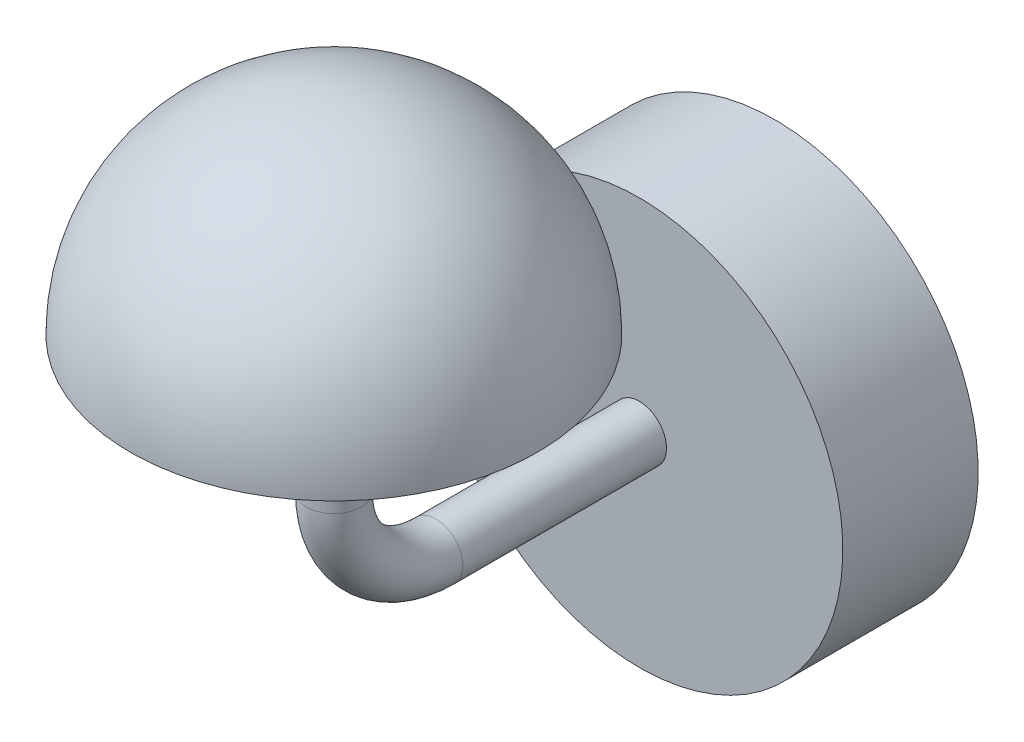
ISO-10303-21;
HEADER;
FILE_DESCRIPTION(('STEP AP214'),'2;1');
FILE_NAME('part.step','',(''),(''),'','','');
FILE_SCHEMA(('AUTOMOTIVE_DESIGN { 1 0 10303 214 1 1 1 1 }'));
ENDSEC;
DATA;
#1=APPLICATION_CONTEXT('core data for automotive mechanical design processes');
#2=APPLICATION_PROTOCOL_DEFINITION('international standard','automotive_design',2000,#1);
#3=PRODUCT_CONTEXT('',#1,'mechanical');
#4=PRODUCT('Part','Part','',(#3));
#5=PRODUCT_RELATED_PRODUCT_CATEGORY('part','',(#4));
#6=PRODUCT_DEFINITION_FORMATION('','',#4);
#7=PRODUCT_DEFINITION_CONTEXT('part definition',#1,'design');
#8=PRODUCT_DEFINITION('design','',#6,#7);
#9=PRODUCT_DEFINITION_SHAPE('','',#8);
#10=(LENGTH_UNIT() NAMED_UNIT(*) SI_UNIT(.MILLI.,.METRE.));
#11=(NAMED_UNIT(*) PLANE_ANGLE_UNIT() SI_UNIT($,.RADIAN.));
#12=(NAMED_UNIT(*) SI_UNIT($,.STERADIAN.) SOLID_ANGLE_UNIT());
#13=UNCERTAINTY_MEASURE_WITH_UNIT(LENGTH_MEASURE(1.E-05),#10,'distance_accuracy_value','');
#14=(GEOMETRIC_REPRESENTATION_CONTEXT(3) GLOBAL_UNCERTAINTY_ASSIGNED_CONTEXT((#13)) GLOBAL_UNIT_ASSIGNED_CONTEXT((#10,
#11,#12)) REPRESENTATION_CONTEXT('',''));
#15=CARTESIAN_POINT('',(0.,0.,0.));
#16=DIRECTION('',(0.,0.,1.));
#17=DIRECTION('',(1.,0.,0.));
#18=AXIS2_PLACEMENT_3D('',#15,#16,#17);
#19=CARTESIAN_POINT('',(11.3333843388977,-28.8148544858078,230.500000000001));
#20=DIRECTION('',(-1.,0.,0.));
#21=DIRECTION('',(0.,0.,-1.));
#22=AXIS2_PLACEMENT_3D('',#19,#20,#21);
#23=TOROIDAL_SURFACE('',#22,29.9999999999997,8.);
#24=CARTESIAN_POINT('',(11.3333843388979,-58.8148544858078,230.500000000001));
#25=DIRECTION('',(0.,0.,-1.));
#26=DIRECTION('',(-1.,0.,0.));
#27=AXIS2_PLACEMENT_3D('',#24,#25,#26);
#28=CIRCLE('',#27,8.);
#29=CARTESIAN_POINT('',(11.333384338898,-66.8148544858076,230.500000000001));
#30=VERTEX_POINT('',#29);
#31=EDGE_CURVE('P0_E61',#30,#30,#28,.T.);
#32=CARTESIAN_POINT('',(11.3333843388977,-28.8148544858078,260.500000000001));
#33=DIRECTION('',(0.,-1.,0.));
#34=DIRECTION('',(1.,0.,0.));
#35=AXIS2_PLACEMENT_3D('',#32,#33,#34);
#36=CIRCLE('',#35,8.);
#37=CARTESIAN_POINT('',(11.3333843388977,-28.8148544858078,268.5));
#38=VERTEX_POINT('',#37);
#39=EDGE_CURVE('P0_E11',#38,#38,#36,.F.);
#40=CARTESIAN_POINT('',(11.3333843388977,-28.8148544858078,230.500000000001));
#41=DIRECTION('',(-1.,0.,0.));
#42=DIRECTION('',(0.,0.,-1.));
#43=AXIS2_PLACEMENT_3D('',#40,#41,#42);
#44=CIRCLE('',#43,37.9999999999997);
#45=EDGE_CURVE('',#30,#38,#44,.T.);
#46=ORIENTED_EDGE('',*,*,#31,.F.);
#47=ORIENTED_EDGE('',*,*,#39,.F.);
#48=ORIENTED_EDGE('',*,*,#45,.T.);
#49=ORIENTED_EDGE('',*,*,#45,.F.);
#50=EDGE_LOOP('',(#46,#48,#47,#49));
#51=FACE_BOUND('',#50,.T.);
#52=ADVANCED_FACE('P0_F48',(#51),#23,.T.);
#53=CARTESIAN_POINT('',(11.3333843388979,-58.8148544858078,170.500000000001));
#54=DIRECTION('',(0.,0.,1.));
#55=DIRECTION('',(1.,0.,0.));
#56=AXIS2_PLACEMENT_3D('',#53,#54,#55);
#57=CYLINDRICAL_SURFACE('',#56,8.);
#58=CARTESIAN_POINT('',(11.3333843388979,-58.8148544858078,170.500000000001));
#59=DIRECTION('',(0.,0.,-1.));
#60=DIRECTION('',(-1.,0.,0.));
#61=AXIS2_PLACEMENT_3D('',#58,#59,#60);
#62=CIRCLE('',#61,8.);
#63=CARTESIAN_POINT('',(3.33338433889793,-58.8148544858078,170.500000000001));
#64=VERTEX_POINT('',#63);
#65=EDGE_CURVE('P0_E55',#64,#64,#62,.T.);
#66=ORIENTED_EDGE('',*,*,#65,.F.);
#67=EDGE_LOOP('',(#66));
#68=FACE_BOUND('',#67,.T.);
#69=ORIENTED_EDGE('',*,*,#31,.T.);
#70=EDGE_LOOP('',(#69));
#71=FACE_BOUND('',#70,.T.);
#72=ADVANCED_FACE('P0_F96',(#68,#71),#57,.T.);
#73=CARTESIAN_POINT('',(11.3333843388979,-58.8148544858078,130.622000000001));
#74=DIRECTION('',(0.,0.,1.));
#75=DIRECTION('',(1.,0.,0.));
#76=AXIS2_PLACEMENT_3D('',#73,#74,#75);
#77=CYLINDRICAL_SURFACE('',#76,59.944);
#78=CARTESIAN_POINT('',(11.3333843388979,-58.8148544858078,130.622000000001));
#79=DIRECTION('',(0.,0.,1.));
#80=DIRECTION('',(-1.,0.,0.));
#81=AXIS2_PLACEMENT_3D('',#78,#79,#80);
#82=CIRCLE('',#81,59.944);
#83=CARTESIAN_POINT('',(-48.6106156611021,-58.8148544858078,130.622000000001));
#84=VERTEX_POINT('',#83);
#85=EDGE_CURVE('P0_E67',#84,#84,#82,.T.);
#86=ORIENTED_EDGE('',*,*,#85,.T.);
#87=EDGE_LOOP('',(#86));
#88=FACE_BOUND('',#87,.T.);
#89=CARTESIAN_POINT('',(11.3333843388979,-58.8148544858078,170.500000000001));
#90=DIRECTION('',(0.,0.,1.));
#91=DIRECTION('',(-1.,0.,0.));
#92=AXIS2_PLACEMENT_3D('',#89,#90,#91);
#93=CIRCLE('',#92,59.944);
#94=CARTESIAN_POINT('',(-48.6106156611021,-58.8148544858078,170.500000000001));
#95=VERTEX_POINT('',#94);
#96=EDGE_CURVE('P0_E69',#95,#95,#93,.T.);
#97=ORIENTED_EDGE('',*,*,#96,.F.);
#98=EDGE_LOOP('',(#97));
#99=FACE_BOUND('',#98,.T.);
#100=ADVANCED_FACE('P0_F102',(#88,#99),#77,.T.);
#101=CARTESIAN_POINT('',(11.3333843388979,-58.8148544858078,130.622000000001));
#102=DIRECTION('',(0.,0.,-1.));
#103=DIRECTION('',(-1.,0.,0.));
#104=AXIS2_PLACEMENT_3D('',#101,#102,#103);
#105=PLANE('',#104);
#106=ORIENTED_EDGE('',*,*,#85,.F.);
#107=EDGE_LOOP('',(#106));
#108=FACE_BOUND('',#107,.T.);
#109=ADVANCED_FACE('P0_F92',(#108),#105,.T.);
#110=CARTESIAN_POINT('',(11.3333843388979,-58.8148544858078,170.500000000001));
#111=DIRECTION('',(0.,0.,-1.));
#112=DIRECTION('',(-1.,0.,0.));
#113=AXIS2_PLACEMENT_3D('',#110,#111,#112);
#114=PLANE('',#113);
#115=ORIENTED_EDGE('',*,*,#65,.T.);
#116=EDGE_LOOP('',(#115));
#117=FACE_BOUND('',#116,.T.);
#118=ORIENTED_EDGE('',*,*,#96,.T.);
#119=EDGE_LOOP('',(#118));
#120=FACE_BOUND('',#119,.T.);
#121=ADVANCED_FACE('P0_F85',(#117,#120),#114,.F.);
#122=CARTESIAN_POINT('',(11.3333843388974,11.1851455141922,260.500000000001));
#123=DIRECTION('',(0.,-1.,0.));
#124=DIRECTION('',(1.,0.,0.));
#125=AXIS2_PLACEMENT_3D('',#122,#123,#124);
#126=CYLINDRICAL_SURFACE('',#125,8.);
#127=CARTESIAN_POINT('',(11.3333843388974,11.1851455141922,260.500000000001));
#128=DIRECTION('',(0.,1.,0.));
#129=DIRECTION('',(-1.,0.,0.));
#130=AXIS2_PLACEMENT_3D('',#127,#128,#129);
#131=CIRCLE('',#130,8.);
#132=CARTESIAN_POINT('',(3.33338433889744,11.1851455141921,260.500000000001));
#133=VERTEX_POINT('',#132);
#134=EDGE_CURVE('P0_E73',#133,#133,#131,.T.);
#135=ORIENTED_EDGE('',*,*,#134,.F.);
#136=EDGE_LOOP('',(#135));
#137=FACE_BOUND('',#136,.T.);
#138=ORIENTED_EDGE('',*,*,#39,.T.);
#139=EDGE_LOOP('',(#138));
#140=FACE_BOUND('',#139,.T.);
#141=ADVANCED_FACE('P0_F83',(#137,#140),#126,.T.);
#142=CARTESIAN_POINT('',(11.3333843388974,11.1851455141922,260.500000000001));
#143=DIRECTION('',(0.,1.,0.));
#144=DIRECTION('',(-1.,0.,0.));
#145=AXIS2_PLACEMENT_3D('',#142,#143,#144);
#146=PLANE('',#145);
#147=ORIENTED_EDGE('',*,*,#134,.T.);
#148=EDGE_LOOP('',(#147));
#149=FACE_BOUND('',#148,.T.);
#150=ADVANCED_FACE('P0_F81',(#149),#146,.T.);
#151=CLOSED_SHELL('',(#52,#72,#100,#109,#121,#141,#150));
#152=MANIFOLD_SOLID_BREP('P0_B2',#151);
#153=CARTESIAN_POINT('',(11.3333843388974,11.1851455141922,260.500000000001));
#154=DIRECTION('',(0.,1.,0.));
#155=DIRECTION('',(-0.617305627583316,0.,0.786723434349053));
#156=AXIS2_PLACEMENT_3D('',#153,#154,#155);
#157=PLANE('',#156);
#158=CARTESIAN_POINT('',(11.3333843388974,11.1851455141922,260.500000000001));
#159=DIRECTION('',(0.,1.,0.));
#160=DIRECTION('',(-0.617305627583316,0.,0.786723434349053));
#161=AXIS2_PLACEMENT_3D('',#158,#159,#160);
#162=CIRCLE('',#161,60.);
#163=CARTESIAN_POINT('',(-25.7049533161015,11.1851455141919,307.703406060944));
#164=VERTEX_POINT('',#163);
#165=EDGE_CURVE('P1_E11',#164,#164,#162,.T.);
#166=ORIENTED_EDGE('',*,*,#165,.F.);
#167=EDGE_LOOP('',(#166));
#168=FACE_BOUND('',#167,.T.);
#169=ADVANCED_FACE('P1_F15',(#168),#157,.F.);
#170=CARTESIAN_POINT('',(11.3333843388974,11.1851455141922,260.500000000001));
#171=DIRECTION('',(0.,1.,0.));
#172=DIRECTION('',(0.617305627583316,0.,-0.786723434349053));
#173=AXIS2_PLACEMENT_3D('',#170,#171,#172);
#174=SPHERICAL_SURFACE('',#173,60.);
#175=ORIENTED_EDGE('',*,*,#165,.T.);
#176=EDGE_LOOP('',(#175));
#177=FACE_BOUND('',#176,.T.);
#178=ADVANCED_FACE('P1_F25',(#177),#174,.T.);
#179=CLOSED_SHELL('',(#169,#178));
#180=MANIFOLD_SOLID_BREP('P1_B1',#179);
#181=ADVANCED_BREP_SHAPE_REPRESENTATION('',(#18,#152,#180),#14);
#182=SHAPE_DEFINITION_REPRESENTATION(#9,#181);
ENDSEC;
END-ISO-10303-21;
